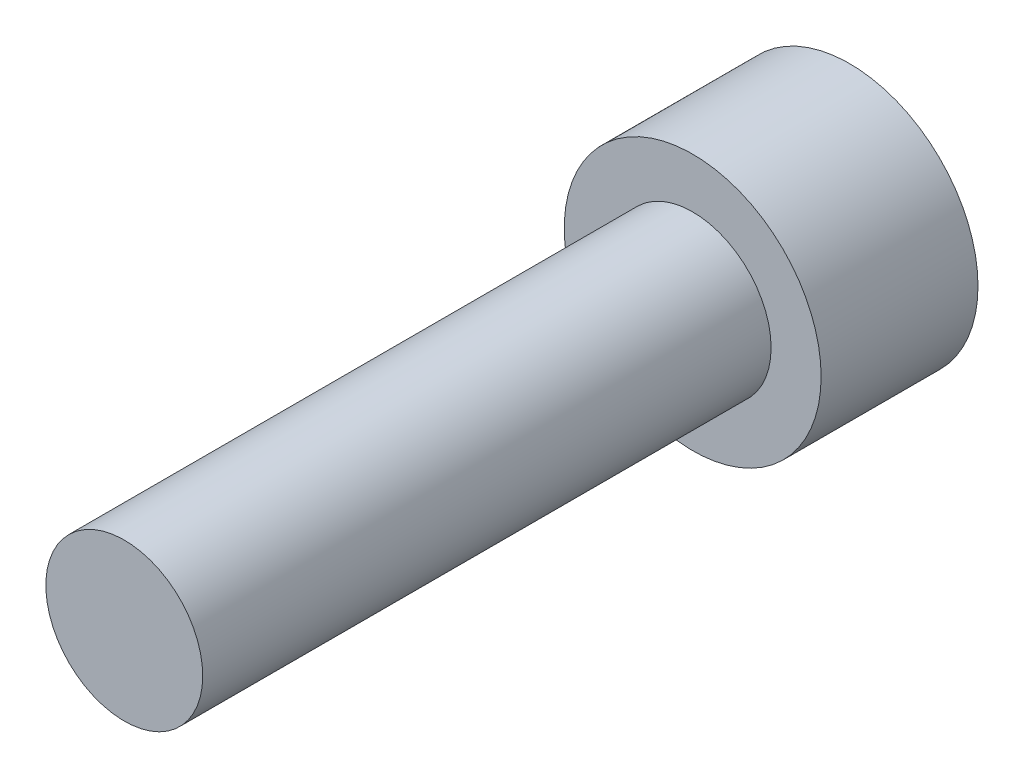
from build123d import *

# Parameters (mm, degrees)
HEX_2_DEPTH = 2.032


with BuildPart() as part:
    # Sketch6 → Revolve1 (revolve)
    with BuildSketch(Plane(origin=(0, 0, 0), x_dir=(0, 0, -1), z_dir=(1, 0, 0)), mode=Mode.PRIVATE) as revolve1_sk:
        Polygon((-12.7, 0), (-12.7, -1.7526), (0, -1.7526), (0, -2.8702), (3.5052, -2.8702), (3.5052, 0), align=None)
    revolve(revolve1_sk.sketch.rotate(Axis((0, 0, 12.7), (0, 0, -1)), 270), axis=Axis((0, 0, 12.7), (0, 0, -1)))

    # Sketch7 → HEX 2 (cut)
    with BuildSketch(Plane(origin=(0, 0, -3.5052), x_dir=(-1, 0, 0), z_dir=(0, 0, -1))):
        Polygon((-1.3843, 0.799225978), (-1.3843, -0.799225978), (0, -1.598451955), (1.3843, -0.799225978), (1.3843, 0.799225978), (0, 1.598451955), align=None)
    extrude(amount=-HEX_2_DEPTH, mode=Mode.SUBTRACT)


solid = part.part
